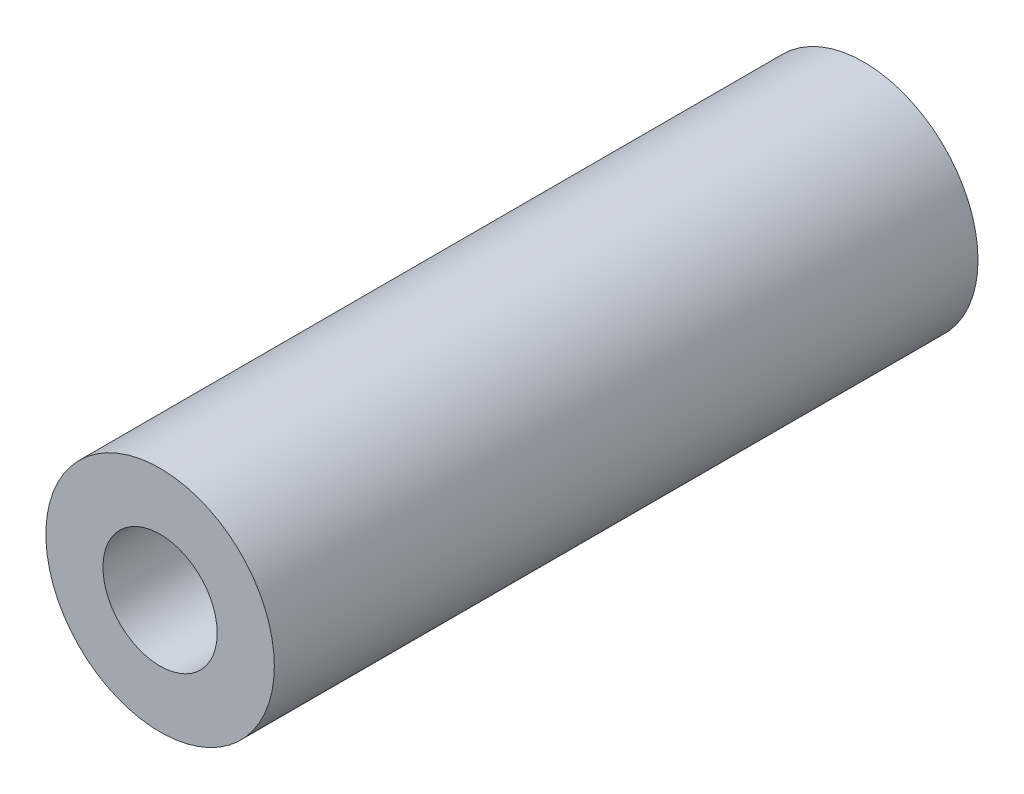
from build123d import *

# Parameters (mm, degrees)
ESQUISSE1_R          = 12.5
ESQUISSE1_R_2        = 6.25
F_69_8_LONG_77_DEPTH = 38.5


with BuildPart() as part:
    # Esquisse1 → 69.8 long 77 (new, symmetric)
    with BuildSketch(Plane.XY):
        Circle(ESQUISSE1_R)
        Circle(ESQUISSE1_R_2, mode=Mode.SUBTRACT)
    extrude(amount=F_69_8_LONG_77_DEPTH, both=True)


solid = part.part
